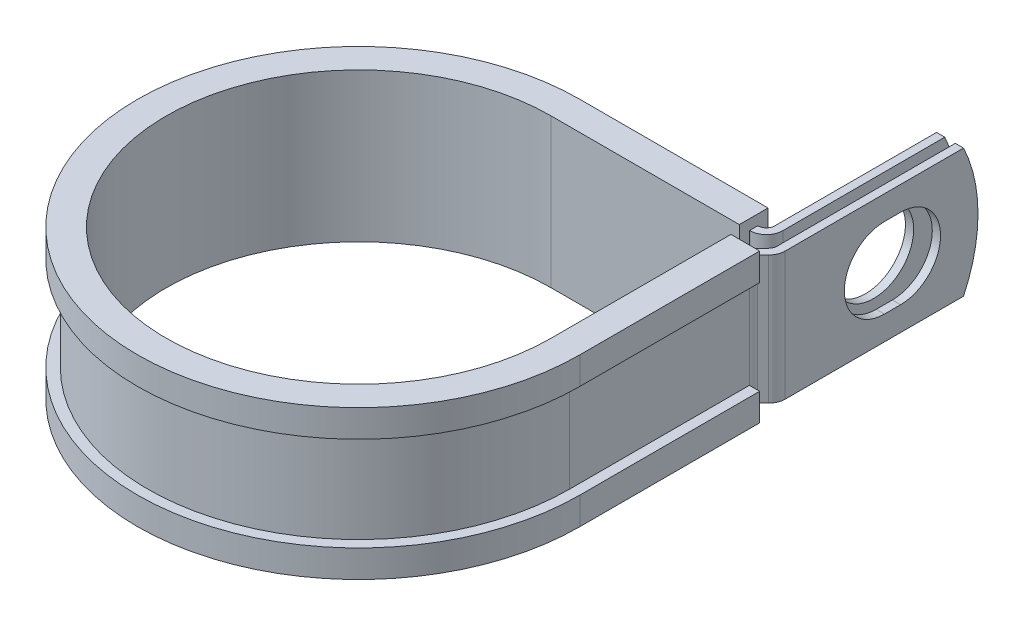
from build123d import *

# Parameters (mm, degrees)
EXTRUDE_THIN1_DEPTH = 9.525
SKETCH2_R           = 5.9436
CUT_EXTRUDE1_DEPTH  = 1.2192
CUT_EXTRUDE2_DEPTH  = 1.2192
CUT_EXTRUDE3_DEPTH  = 85.865064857


with BuildPart() as part:
    # Sketch1 → Extrude-Thin1 (new, symmetric)
    with BuildSketch(Plane(origin=(0, 0, 0), x_dir=(1, 0, 0), z_dir=(0, 1, 0))):
        with BuildLine():
            Line((31.9964698, 58.7248), (31.9964698, 30.099))
            ThreePointArc((31.9964698, 30.099), (31.903663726, 29.632432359), (31.639374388, 29.236895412))
            Line((31.639374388, 29.236895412), (30.813190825, 28.410711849))
            ThreePointArc((30.813190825, 28.410711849), (30.284612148, 27.619637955), (30.099, 26.686502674))
            Line((30.099, 26.686502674), (30.099, 0))
            ThreePointArc((30.099, 0), (-21.283207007, -21.283207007), (0, 30.099))
            Line((0, 30.099), (27.9832698, 30.099))
            ThreePointArc((27.9832698, 30.099), (29.707478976, 30.813190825), (30.4216698, 32.5374))
            Line((30.4216698, 32.5374), (30.4216698, 58.7248))
            Line((30.4216698, 58.7248), (29.2024698, 58.7248))
            Line((29.2024698, 58.7248), (29.2024698, 32.5374))
            ThreePointArc((29.2024698, 32.5374), (28.845374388, 31.675295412), (27.9832698, 31.3182))
            Line((27.9832698, 31.3182), (0, 31.3182))
            ThreePointArc((0, 31.3182), (-22.145311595, -22.145311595), (31.3182, 0))
            Line((31.3182, 0), (31.3182, 26.686502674))
            ThreePointArc((31.3182, 26.686502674), (31.411006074, 27.153070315), (31.675295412, 27.548607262))
            Line((31.675295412, 27.548607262), (32.501478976, 28.374790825))
            ThreePointArc((32.501478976, 28.374790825), (33.030057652, 29.165864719), (33.2156698, 30.099))
            Line((33.2156698, 30.099), (33.2156698, 58.7248))
            Line((33.2156698, 58.7248), (31.9964698, 58.7248))
        make_face()
    extrude(amount=EXTRUDE_THIN1_DEPTH, both=True)

    # Sketch2 → Cut-Extrude1 (cut)
    with BuildSketch(Plane.ZY.offset(-29.2024698)):
        with Locations((-46.0248, 0)):
            Circle(SKETCH2_R)
    extrude(amount=-CUT_EXTRUDE1_DEPTH, mode=Mode.SUBTRACT)

    # Sketch3 → Cut-Extrude2 (cut)
    with BuildSketch(Plane(origin=(33.2156698, 0, 0), x_dir=(0, 0, -1), z_dir=(1, 0, 0))):
        with BuildLine():
            Line((44.831, 5.9436), (47.2186, 5.9436))
            ThreePointArc((47.2186, 5.9436), (53.1622, 0), (47.2186, -5.9436))
            Line((47.2186, -5.9436), (44.831, -5.9436))
            ThreePointArc((44.831, -5.9436), (38.8874, 0), (44.831, 5.9436))
        make_face()
    extrude(amount=-CUT_EXTRUDE2_DEPTH, mode=Mode.SUBTRACT)

    # Sketch4 → Cut-Extrude3 (cut, through all)
    with BuildSketch(Plane.ZY.offset(-29.2024698)):
        with BuildLine():
            Line((-56.580263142, 9.525), (-58.7248, 9.525))
            Line((-58.7248, 9.525), (-58.7248, -1e-09))
            ThreePointArc((-58.7248, -1e-09), (-58.182038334, 4.881717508), (-56.580263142, 9.525))
        make_face()
        with BuildLine():
            ThreePointArc((-56.580263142, -9.525), (-58.182038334, -4.881717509), (-58.7248, -1e-09))
            Line((-58.7248, -1e-09), (-58.7248, -9.525))
            Line((-58.7248, -9.525), (-56.580263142, -9.525))
        make_face()
    extrude(amount=-CUT_EXTRUDE3_DEPTH, mode=Mode.SUBTRACT)

    # Sweep1: sweep along a path in Sketch6
    with BuildLine(Plane(origin=(0, 9.525, 0), x_dir=(1, 0, 0), z_dir=(0, 1, 0))) as sweep1_path:
        Line((28.575, 26.686502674), (28.575, 0))
        ThreePointArc((28.575, 0), (-20.205576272, -20.205576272), (0, 28.575))
        Line((0, 28.575), (27.9324698, 28.575))
    # Sketch5 → Sweep1 (sweep)
    with BuildSketch(Plane(origin=(0, 0, -26.686502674), x_dir=(-1, 0, 0), z_dir=(0, 0, -1))):
        Polygon((-31.3182, 9.525), (-30.099, 9.525), (-30.099, -9.525), (-31.3182, -9.525), (-31.3182, -6.985), (-32.8422, -6.985), (-32.8422, -11.049), (-28.575, -11.049), (-28.575, 11.049), (-32.8422, 11.049), (-32.8422, 6.985), (-31.3182, 6.985), align=None)
    sweep(path=sweep1_path.line)


solid = part.part
